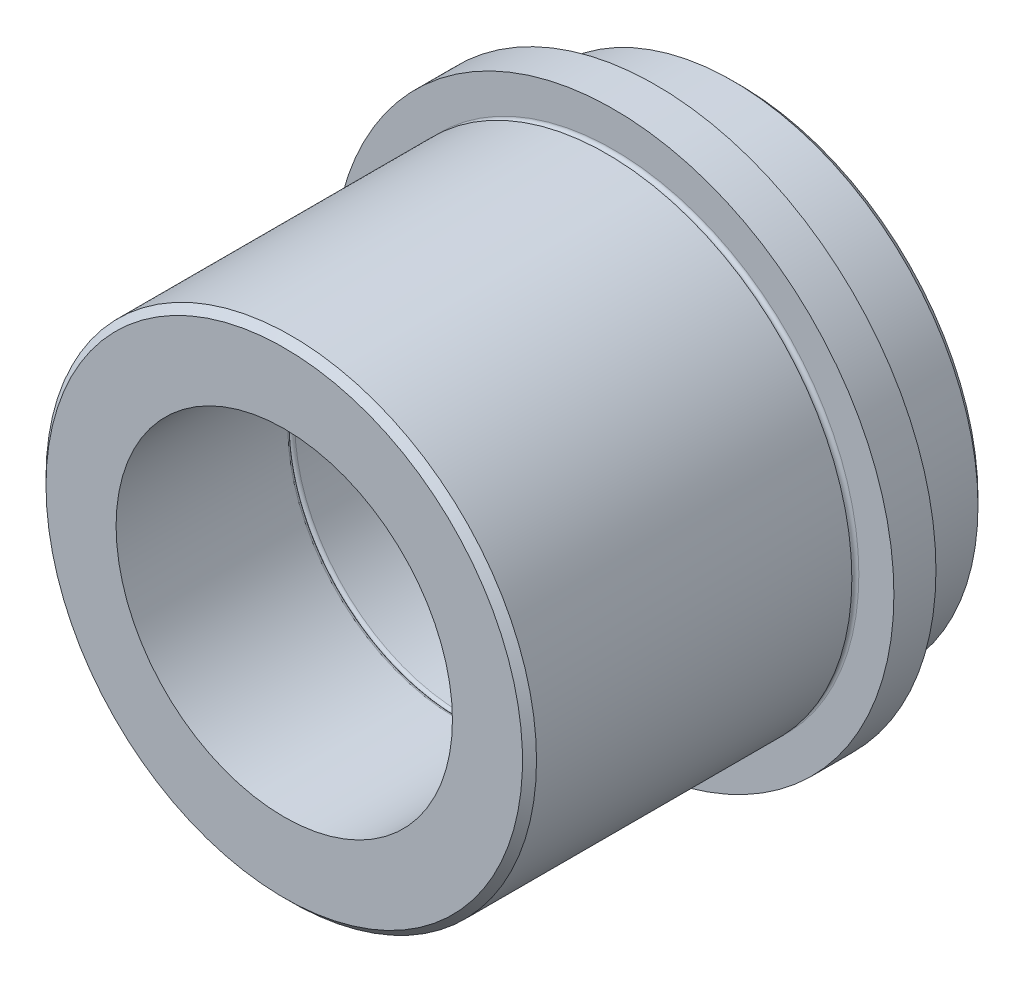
ISO-10303-21;
HEADER;
FILE_DESCRIPTION(('STEP AP214'),'2;1');
FILE_NAME('part.step','',(''),(''),'','','');
FILE_SCHEMA(('AUTOMOTIVE_DESIGN { 1 0 10303 214 1 1 1 1 }'));
ENDSEC;
DATA;
#1=APPLICATION_CONTEXT('core data for automotive mechanical design processes');
#2=APPLICATION_PROTOCOL_DEFINITION('international standard','automotive_design',2000,#1);
#3=PRODUCT_CONTEXT('',#1,'mechanical');
#4=PRODUCT('Part','Part','',(#3));
#5=PRODUCT_RELATED_PRODUCT_CATEGORY('part','',(#4));
#6=PRODUCT_DEFINITION_FORMATION('','',#4);
#7=PRODUCT_DEFINITION_CONTEXT('part definition',#1,'design');
#8=PRODUCT_DEFINITION('design','',#6,#7);
#9=PRODUCT_DEFINITION_SHAPE('','',#8);
#10=(LENGTH_UNIT() NAMED_UNIT(*) SI_UNIT(.MILLI.,.METRE.));
#11=(NAMED_UNIT(*) PLANE_ANGLE_UNIT() SI_UNIT($,.RADIAN.));
#12=(NAMED_UNIT(*) SI_UNIT($,.STERADIAN.) SOLID_ANGLE_UNIT());
#13=UNCERTAINTY_MEASURE_WITH_UNIT(LENGTH_MEASURE(1.E-05),#10,'distance_accuracy_value','');
#14=(GEOMETRIC_REPRESENTATION_CONTEXT(3) GLOBAL_UNCERTAINTY_ASSIGNED_CONTEXT((#13)) GLOBAL_UNIT_ASSIGNED_CONTEXT((#10,
#11,#12)) REPRESENTATION_CONTEXT('',''));
#15=CARTESIAN_POINT('',(0.,0.,0.));
#16=DIRECTION('',(0.,0.,1.));
#17=DIRECTION('',(1.,0.,0.));
#18=AXIS2_PLACEMENT_3D('',#15,#16,#17);
#19=CARTESIAN_POINT('',(0.,0.,0.));
#20=DIRECTION('',(0.,0.,1.));
#21=DIRECTION('',(1.,0.,0.));
#22=AXIS2_PLACEMENT_3D('',#19,#20,#21);
#23=CYLINDRICAL_SURFACE('',#22,24.);
#24=CARTESIAN_POINT('',(0.,0.,-24.5));
#25=DIRECTION('',(0.,0.,1.));
#26=DIRECTION('',(1.,0.,0.));
#27=AXIS2_PLACEMENT_3D('',#24,#25,#26);
#28=CIRCLE('',#27,24.);
#29=CARTESIAN_POINT('',(24.,0.,-24.5));
#30=VERTEX_POINT('',#29);
#31=EDGE_CURVE('E69',#30,#30,#28,.T.);
#32=ORIENTED_EDGE('',*,*,#31,.F.);
#33=EDGE_LOOP('',(#32));
#34=FACE_BOUND('',#33,.T.);
#35=CARTESIAN_POINT('',(0.,0.,0.));
#36=DIRECTION('',(0.,0.,1.));
#37=DIRECTION('',(1.,0.,0.));
#38=AXIS2_PLACEMENT_3D('',#35,#36,#37);
#39=CIRCLE('',#38,24.);
#40=CARTESIAN_POINT('',(24.,0.,0.));
#41=VERTEX_POINT('',#40);
#42=EDGE_CURVE('E33',#41,#41,#39,.T.);
#43=ORIENTED_EDGE('',*,*,#42,.T.);
#44=EDGE_LOOP('',(#43));
#45=FACE_BOUND('',#44,.T.);
#46=ADVANCED_FACE('F13',(#34,#45),#23,.F.);
#47=CARTESIAN_POINT('',(0.,24.,0.));
#48=DIRECTION('',(0.,0.,-1.));
#49=DIRECTION('',(-1.,0.,0.));
#50=AXIS2_PLACEMENT_3D('',#47,#48,#49);
#51=PLANE('',#50);
#52=CARTESIAN_POINT('',(0.,0.,0.));
#53=DIRECTION('',(0.,0.,-1.));
#54=DIRECTION('',(-1.,0.,0.));
#55=AXIS2_PLACEMENT_3D('',#52,#53,#54);
#56=CIRCLE('',#55,34.);
#57=CARTESIAN_POINT('',(-34.,0.,0.));
#58=VERTEX_POINT('',#57);
#59=EDGE_CURVE('E20',#58,#58,#56,.F.);
#60=ORIENTED_EDGE('',*,*,#59,.T.);
#61=EDGE_LOOP('',(#60));
#62=FACE_BOUND('',#61,.T.);
#63=ORIENTED_EDGE('',*,*,#42,.F.);
#64=EDGE_LOOP('',(#63));
#65=FACE_BOUND('',#64,.T.);
#66=ADVANCED_FACE('F77',(#62,#65),#51,.F.);
#67=CARTESIAN_POINT('',(0.,0.,0.));
#68=DIRECTION('',(0.,0.,1.));
#69=DIRECTION('',(1.,0.,0.));
#70=AXIS2_PLACEMENT_3D('',#67,#68,#69);
#71=CYLINDRICAL_SURFACE('',#70,35.);
#72=CARTESIAN_POINT('',(0.,0.,-1.));
#73=DIRECTION('',(0.,0.,-1.));
#74=DIRECTION('',(-1.,0.,0.));
#75=AXIS2_PLACEMENT_3D('',#72,#73,#74);
#76=CIRCLE('',#75,35.);
#77=CARTESIAN_POINT('',(-35.,0.,-1.));
#78=VERTEX_POINT('',#77);
#79=EDGE_CURVE('E8',#78,#78,#76,.T.);
#80=ORIENTED_EDGE('',*,*,#79,.T.);
#81=EDGE_LOOP('',(#80));
#82=FACE_BOUND('',#81,.T.);
#83=CARTESIAN_POINT('',(0.,0.,-46.));
#84=DIRECTION('',(0.,0.,1.));
#85=DIRECTION('',(1.,0.,0.));
#86=AXIS2_PLACEMENT_3D('',#83,#84,#85);
#87=CIRCLE('',#86,35.);
#88=CARTESIAN_POINT('',(35.,0.,-46.));
#89=VERTEX_POINT('',#88);
#90=EDGE_CURVE('E36',#89,#89,#87,.T.);
#91=ORIENTED_EDGE('',*,*,#90,.T.);
#92=EDGE_LOOP('',(#91));
#93=FACE_BOUND('',#92,.T.);
#94=ADVANCED_FACE('F82',(#82,#93),#71,.T.);
#95=CARTESIAN_POINT('',(0.,0.,-46.5));
#96=DIRECTION('',(0.,0.,1.));
#97=DIRECTION('',(1.,0.,0.));
#98=AXIS2_PLACEMENT_3D('',#95,#96,#97);
#99=TOROIDAL_SURFACE('',#98,35.,0.5);
#100=ORIENTED_EDGE('',*,*,#90,.F.);
#101=EDGE_LOOP('',(#100));
#102=FACE_BOUND('',#101,.T.);
#103=CARTESIAN_POINT('',(0.,0.,-47.));
#104=DIRECTION('',(0.,0.,1.));
#105=DIRECTION('',(1.,0.,0.));
#106=AXIS2_PLACEMENT_3D('',#103,#104,#105);
#107=CIRCLE('',#106,35.);
#108=CARTESIAN_POINT('',(35.,0.,-47.));
#109=VERTEX_POINT('',#108);
#110=EDGE_CURVE('E39',#109,#109,#107,.T.);
#111=ORIENTED_EDGE('',*,*,#110,.T.);
#112=EDGE_LOOP('',(#111));
#113=FACE_BOUND('',#112,.T.);
#114=ADVANCED_FACE('F89',(#102,#113),#99,.F.);
#115=CARTESIAN_POINT('',(0.,35.,-47.));
#116=DIRECTION('',(0.,0.,-1.));
#117=DIRECTION('',(-1.,0.,0.));
#118=AXIS2_PLACEMENT_3D('',#115,#116,#117);
#119=PLANE('',#118);
#120=ORIENTED_EDGE('',*,*,#110,.F.);
#121=EDGE_LOOP('',(#120));
#122=FACE_BOUND('',#121,.T.);
#123=CARTESIAN_POINT('',(0.,0.,-47.));
#124=DIRECTION('',(0.,0.,1.));
#125=DIRECTION('',(1.,0.,0.));
#126=AXIS2_PLACEMENT_3D('',#123,#124,#125);
#127=CIRCLE('',#126,40.);
#128=CARTESIAN_POINT('',(40.,0.,-47.));
#129=VERTEX_POINT('',#128);
#130=EDGE_CURVE('E42',#129,#129,#127,.T.);
#131=ORIENTED_EDGE('',*,*,#130,.T.);
#132=EDGE_LOOP('',(#131));
#133=FACE_BOUND('',#132,.T.);
#134=ADVANCED_FACE('F124',(#122,#133),#119,.F.);
#135=CARTESIAN_POINT('',(0.,0.,0.));
#136=DIRECTION('',(0.,0.,1.));
#137=DIRECTION('',(1.,0.,0.));
#138=AXIS2_PLACEMENT_3D('',#135,#136,#137);
#139=CYLINDRICAL_SURFACE('',#138,40.);
#140=ORIENTED_EDGE('',*,*,#130,.F.);
#141=EDGE_LOOP('',(#140));
#142=FACE_BOUND('',#141,.T.);
#143=CARTESIAN_POINT('',(0.,0.,-53.));
#144=DIRECTION('',(0.,0.,1.));
#145=DIRECTION('',(1.,0.,0.));
#146=AXIS2_PLACEMENT_3D('',#143,#144,#145);
#147=CIRCLE('',#146,40.);
#148=CARTESIAN_POINT('',(40.,0.,-53.));
#149=VERTEX_POINT('',#148);
#150=EDGE_CURVE('E45',#149,#149,#147,.T.);
#151=ORIENTED_EDGE('',*,*,#150,.T.);
#152=EDGE_LOOP('',(#151));
#153=FACE_BOUND('',#152,.T.);
#154=ADVANCED_FACE('F117',(#142,#153),#139,.T.);
#155=CARTESIAN_POINT('',(0.,40.,-53.));
#156=DIRECTION('',(0.,0.,1.));
#157=DIRECTION('',(1.,0.,0.));
#158=AXIS2_PLACEMENT_3D('',#155,#156,#157);
#159=PLANE('',#158);
#160=ORIENTED_EDGE('',*,*,#150,.F.);
#161=EDGE_LOOP('',(#160));
#162=FACE_BOUND('',#161,.T.);
#163=CARTESIAN_POINT('',(0.,0.,-53.));
#164=DIRECTION('',(0.,0.,1.));
#165=DIRECTION('',(1.,0.,0.));
#166=AXIS2_PLACEMENT_3D('',#163,#164,#165);
#167=CIRCLE('',#166,35.);
#168=CARTESIAN_POINT('',(35.,0.,-53.));
#169=VERTEX_POINT('',#168);
#170=EDGE_CURVE('E48',#169,#169,#167,.T.);
#171=ORIENTED_EDGE('',*,*,#170,.T.);
#172=EDGE_LOOP('',(#171));
#173=FACE_BOUND('',#172,.T.);
#174=ADVANCED_FACE('F112',(#162,#173),#159,.F.);
#175=CARTESIAN_POINT('',(0.,0.,0.));
#176=DIRECTION('',(0.,0.,1.));
#177=DIRECTION('',(1.,0.,0.));
#178=AXIS2_PLACEMENT_3D('',#175,#176,#177);
#179=CYLINDRICAL_SURFACE('',#178,35.);
#180=CARTESIAN_POINT('',(0.,0.,-64.));
#181=DIRECTION('',(0.,0.,1.));
#182=DIRECTION('',(1.,0.,0.));
#183=AXIS2_PLACEMENT_3D('',#180,#181,#182);
#184=CIRCLE('',#183,35.);
#185=CARTESIAN_POINT('',(35.,0.,-64.));
#186=VERTEX_POINT('',#185);
#187=EDGE_CURVE('E28',#186,#186,#184,.T.);
#188=ORIENTED_EDGE('',*,*,#187,.T.);
#189=EDGE_LOOP('',(#188));
#190=FACE_BOUND('',#189,.T.);
#191=ORIENTED_EDGE('',*,*,#170,.F.);
#192=EDGE_LOOP('',(#191));
#193=FACE_BOUND('',#192,.T.);
#194=ADVANCED_FACE('F108',(#190,#193),#179,.T.);
#195=CARTESIAN_POINT('',(0.,35.,-65.));
#196=DIRECTION('',(0.,0.,1.));
#197=DIRECTION('',(1.,0.,0.));
#198=AXIS2_PLACEMENT_3D('',#195,#196,#197);
#199=PLANE('',#198);
#200=CARTESIAN_POINT('',(0.,0.,-65.));
#201=DIRECTION('',(0.,0.,1.));
#202=DIRECTION('',(1.,0.,0.));
#203=AXIS2_PLACEMENT_3D('',#200,#201,#202);
#204=CIRCLE('',#203,34.);
#205=CARTESIAN_POINT('',(34.,0.,-65.));
#206=VERTEX_POINT('',#205);
#207=EDGE_CURVE('E24',#206,#206,#204,.F.);
#208=ORIENTED_EDGE('',*,*,#207,.T.);
#209=EDGE_LOOP('',(#208));
#210=FACE_BOUND('',#209,.T.);
#211=CARTESIAN_POINT('',(0.,0.,-65.));
#212=DIRECTION('',(0.,0.,1.));
#213=DIRECTION('',(1.,0.,0.));
#214=AXIS2_PLACEMENT_3D('',#211,#212,#213);
#215=CIRCLE('',#214,24.);
#216=CARTESIAN_POINT('',(24.,0.,-65.));
#217=VERTEX_POINT('',#216);
#218=EDGE_CURVE('E51',#217,#217,#215,.T.);
#219=ORIENTED_EDGE('',*,*,#218,.T.);
#220=EDGE_LOOP('',(#219));
#221=FACE_BOUND('',#220,.T.);
#222=ADVANCED_FACE('F111',(#210,#221),#199,.F.);
#223=CARTESIAN_POINT('',(0.,0.,0.));
#224=DIRECTION('',(0.,0.,1.));
#225=DIRECTION('',(1.,0.,0.));
#226=AXIS2_PLACEMENT_3D('',#223,#224,#225);
#227=CYLINDRICAL_SURFACE('',#226,24.);
#228=ORIENTED_EDGE('',*,*,#218,.F.);
#229=EDGE_LOOP('',(#228));
#230=FACE_BOUND('',#229,.T.);
#231=CARTESIAN_POINT('',(0.,0.,-49.5));
#232=DIRECTION('',(0.,0.,1.));
#233=DIRECTION('',(1.,0.,0.));
#234=AXIS2_PLACEMENT_3D('',#231,#232,#233);
#235=CIRCLE('',#234,24.);
#236=CARTESIAN_POINT('',(24.,0.,-49.5));
#237=VERTEX_POINT('',#236);
#238=EDGE_CURVE('E54',#237,#237,#235,.T.);
#239=ORIENTED_EDGE('',*,*,#238,.T.);
#240=EDGE_LOOP('',(#239));
#241=FACE_BOUND('',#240,.T.);
#242=ADVANCED_FACE('F240',(#230,#241),#227,.F.);
#243=CARTESIAN_POINT('',(0.,0.,-49.5));
#244=DIRECTION('',(0.,0.,1.));
#245=DIRECTION('',(1.,0.,0.));
#246=AXIS2_PLACEMENT_3D('',#243,#244,#245);
#247=TOROIDAL_SURFACE('',#246,24.5,0.5);
#248=ORIENTED_EDGE('',*,*,#238,.F.);
#249=EDGE_LOOP('',(#248));
#250=FACE_BOUND('',#249,.T.);
#251=CARTESIAN_POINT('',(0.,0.,-49.));
#252=DIRECTION('',(0.,0.,1.));
#253=DIRECTION('',(1.,0.,0.));
#254=AXIS2_PLACEMENT_3D('',#251,#252,#253);
#255=CIRCLE('',#254,24.5);
#256=CARTESIAN_POINT('',(24.5,0.,-49.));
#257=VERTEX_POINT('',#256);
#258=EDGE_CURVE('E57',#257,#257,#255,.T.);
#259=ORIENTED_EDGE('',*,*,#258,.T.);
#260=EDGE_LOOP('',(#259));
#261=FACE_BOUND('',#260,.T.);
#262=ADVANCED_FACE('F231',(#250,#261),#247,.T.);
#263=CARTESIAN_POINT('',(0.,0.,-48.5));
#264=DIRECTION('',(0.,0.,1.));
#265=DIRECTION('',(1.,0.,0.));
#266=AXIS2_PLACEMENT_3D('',#263,#264,#265);
#267=TOROIDAL_SURFACE('',#266,24.5,0.5);
#268=ORIENTED_EDGE('',*,*,#258,.F.);
#269=EDGE_LOOP('',(#268));
#270=FACE_BOUND('',#269,.T.);
#271=CARTESIAN_POINT('',(0.,0.,-48.5));
#272=DIRECTION('',(0.,0.,1.));
#273=DIRECTION('',(1.,0.,0.));
#274=AXIS2_PLACEMENT_3D('',#271,#272,#273);
#275=CIRCLE('',#274,24.);
#276=CARTESIAN_POINT('',(24.,0.,-48.5));
#277=VERTEX_POINT('',#276);
#278=EDGE_CURVE('E60',#277,#277,#275,.T.);
#279=ORIENTED_EDGE('',*,*,#278,.T.);
#280=EDGE_LOOP('',(#279));
#281=FACE_BOUND('',#280,.T.);
#282=ADVANCED_FACE('F222',(#270,#281),#267,.T.);
#283=CARTESIAN_POINT('',(0.,0.,0.));
#284=DIRECTION('',(0.,0.,1.));
#285=DIRECTION('',(1.,0.,0.));
#286=AXIS2_PLACEMENT_3D('',#283,#284,#285);
#287=CYLINDRICAL_SURFACE('',#286,24.);
#288=ORIENTED_EDGE('',*,*,#278,.F.);
#289=EDGE_LOOP('',(#288));
#290=FACE_BOUND('',#289,.T.);
#291=CARTESIAN_POINT('',(0.,0.,-25.5));
#292=DIRECTION('',(0.,0.,1.));
#293=DIRECTION('',(1.,0.,0.));
#294=AXIS2_PLACEMENT_3D('',#291,#292,#293);
#295=CIRCLE('',#294,24.);
#296=CARTESIAN_POINT('',(24.,0.,-25.5));
#297=VERTEX_POINT('',#296);
#298=EDGE_CURVE('E63',#297,#297,#295,.T.);
#299=ORIENTED_EDGE('',*,*,#298,.T.);
#300=EDGE_LOOP('',(#299));
#301=FACE_BOUND('',#300,.T.);
#302=ADVANCED_FACE('F214',(#290,#301),#287,.F.);
#303=CARTESIAN_POINT('',(0.,0.,-25.5));
#304=DIRECTION('',(0.,0.,1.));
#305=DIRECTION('',(1.,0.,0.));
#306=AXIS2_PLACEMENT_3D('',#303,#304,#305);
#307=TOROIDAL_SURFACE('',#306,24.5,0.5);
#308=ORIENTED_EDGE('',*,*,#298,.F.);
#309=EDGE_LOOP('',(#308));
#310=FACE_BOUND('',#309,.T.);
#311=CARTESIAN_POINT('',(0.,0.,-25.));
#312=DIRECTION('',(0.,0.,1.));
#313=DIRECTION('',(1.,0.,0.));
#314=AXIS2_PLACEMENT_3D('',#311,#312,#313);
#315=CIRCLE('',#314,24.5);
#316=CARTESIAN_POINT('',(24.5,0.,-25.));
#317=VERTEX_POINT('',#316);
#318=EDGE_CURVE('E66',#317,#317,#315,.T.);
#319=ORIENTED_EDGE('',*,*,#318,.T.);
#320=EDGE_LOOP('',(#319));
#321=FACE_BOUND('',#320,.T.);
#322=ADVANCED_FACE('F101',(#310,#321),#307,.T.);
#323=CARTESIAN_POINT('',(0.,0.,-24.5));
#324=DIRECTION('',(0.,0.,1.));
#325=DIRECTION('',(1.,0.,0.));
#326=AXIS2_PLACEMENT_3D('',#323,#324,#325);
#327=TOROIDAL_SURFACE('',#326,24.5,0.5);
#328=ORIENTED_EDGE('',*,*,#318,.F.);
#329=EDGE_LOOP('',(#328));
#330=FACE_BOUND('',#329,.T.);
#331=ORIENTED_EDGE('',*,*,#31,.T.);
#332=EDGE_LOOP('',(#331));
#333=FACE_BOUND('',#332,.T.);
#334=ADVANCED_FACE('F73',(#330,#333),#327,.T.);
#335=CARTESIAN_POINT('',(0.,0.,-64.));
#336=DIRECTION('',(0.,0.,1.));
#337=DIRECTION('',(1.,0.,0.));
#338=AXIS2_PLACEMENT_3D('',#335,#336,#337);
#339=CONICAL_SURFACE('',#338,35.,0.785398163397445);
#340=ORIENTED_EDGE('',*,*,#207,.F.);
#341=EDGE_LOOP('',(#340));
#342=FACE_BOUND('',#341,.T.);
#343=ORIENTED_EDGE('',*,*,#187,.F.);
#344=EDGE_LOOP('',(#343));
#345=FACE_BOUND('',#344,.T.);
#346=ADVANCED_FACE('F92',(#342,#345),#339,.T.);
#347=CARTESIAN_POINT('',(0.,0.,0.));
#348=DIRECTION('',(0.,0.,-1.));
#349=DIRECTION('',(-1.,0.,0.));
#350=AXIS2_PLACEMENT_3D('',#347,#348,#349);
#351=CONICAL_SURFACE('',#350,34.,0.785398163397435);
#352=ORIENTED_EDGE('',*,*,#79,.F.);
#353=EDGE_LOOP('',(#352));
#354=FACE_BOUND('',#353,.T.);
#355=ORIENTED_EDGE('',*,*,#59,.F.);
#356=EDGE_LOOP('',(#355));
#357=FACE_BOUND('',#356,.T.);
#358=ADVANCED_FACE('F15',(#354,#357),#351,.T.);
#359=CLOSED_SHELL('',(#46,#66,#94,#114,#134,#154,#174,#194,#222,#242,#262,#282,#302,#322,#334,
#346,#358));
#360=MANIFOLD_SOLID_BREP('B1',#359);
#361=ADVANCED_BREP_SHAPE_REPRESENTATION('',(#18,#360),#14);
#362=SHAPE_DEFINITION_REPRESENTATION(#9,#361);
ENDSEC;
END-ISO-10303-21;
